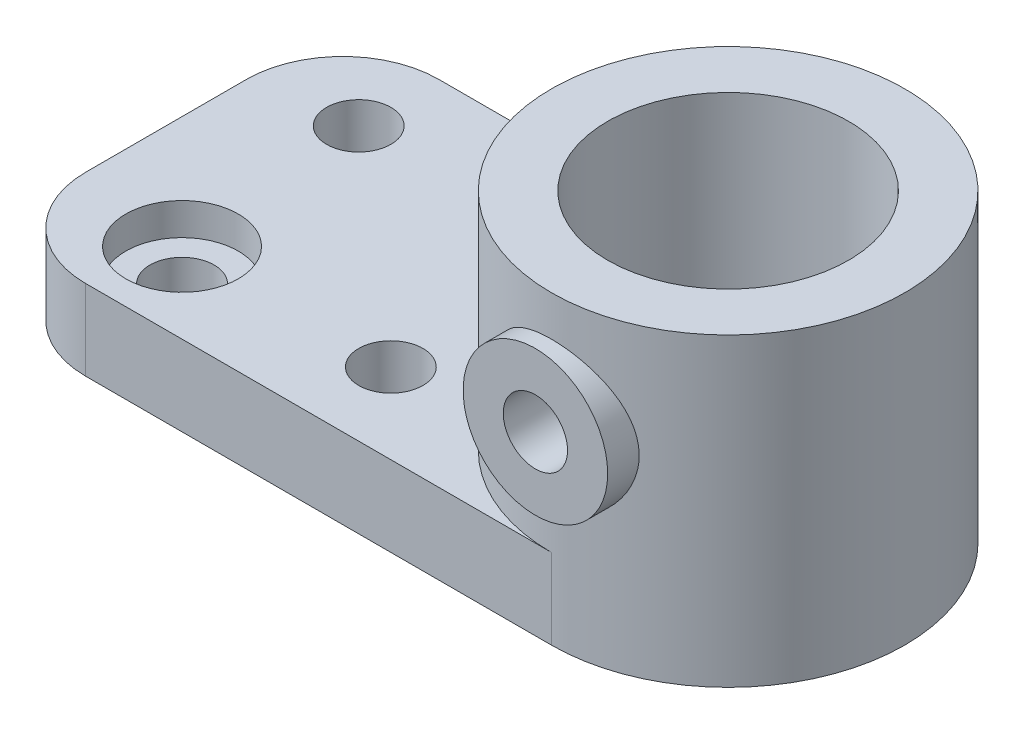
ISO-10303-21;
HEADER;
FILE_DESCRIPTION(('STEP AP214'),'2;1');
FILE_NAME('part.step','',(''),(''),'','','');
FILE_SCHEMA(('AUTOMOTIVE_DESIGN { 1 0 10303 214 1 1 1 1 }'));
ENDSEC;
DATA;
#1=APPLICATION_CONTEXT('core data for automotive mechanical design processes');
#2=APPLICATION_PROTOCOL_DEFINITION('international standard','automotive_design',2000,#1);
#3=PRODUCT_CONTEXT('',#1,'mechanical');
#4=PRODUCT('Part','Part','',(#3));
#5=PRODUCT_RELATED_PRODUCT_CATEGORY('part','',(#4));
#6=PRODUCT_DEFINITION_FORMATION('','',#4);
#7=PRODUCT_DEFINITION_CONTEXT('part definition',#1,'design');
#8=PRODUCT_DEFINITION('design','',#6,#7);
#9=PRODUCT_DEFINITION_SHAPE('','',#8);
#10=(LENGTH_UNIT() NAMED_UNIT(*) SI_UNIT(.MILLI.,.METRE.));
#11=(NAMED_UNIT(*) PLANE_ANGLE_UNIT() SI_UNIT($,.RADIAN.));
#12=(NAMED_UNIT(*) SI_UNIT($,.STERADIAN.) SOLID_ANGLE_UNIT());
#13=UNCERTAINTY_MEASURE_WITH_UNIT(LENGTH_MEASURE(1.E-05),#10,'distance_accuracy_value','');
#14=(GEOMETRIC_REPRESENTATION_CONTEXT(3) GLOBAL_UNCERTAINTY_ASSIGNED_CONTEXT((#13)) GLOBAL_UNIT_ASSIGNED_CONTEXT((#10,
#11,#12)) REPRESENTATION_CONTEXT('',''));
#15=CARTESIAN_POINT('',(0.,0.,0.));
#16=DIRECTION('',(0.,0.,1.));
#17=DIRECTION('',(1.,0.,0.));
#18=AXIS2_PLACEMENT_3D('',#15,#16,#17);
#19=CARTESIAN_POINT('',(-32.,10.,-12.));
#20=DIRECTION('',(0.,-1.,0.));
#21=DIRECTION('',(0.,0.,-1.));
#22=AXIS2_PLACEMENT_3D('',#19,#20,#21);
#23=CYLINDRICAL_SURFACE('',#22,4.);
#24=CARTESIAN_POINT('',(-32.,0.,-12.));
#25=DIRECTION('',(0.,1.,0.));
#26=DIRECTION('',(0.,0.,1.));
#27=AXIS2_PLACEMENT_3D('',#24,#25,#26);
#28=CIRCLE('',#27,4.);
#29=CARTESIAN_POINT('',(-32.,0.,-8.));
#30=VERTEX_POINT('',#29);
#31=EDGE_CURVE('E143',#30,#30,#28,.T.);
#32=ORIENTED_EDGE('',*,*,#31,.F.);
#33=EDGE_LOOP('',(#32));
#34=FACE_BOUND('',#33,.T.);
#35=CARTESIAN_POINT('',(-32.,6.,-12.));
#36=DIRECTION('',(0.,1.,0.));
#37=DIRECTION('',(0.,0.,1.));
#38=AXIS2_PLACEMENT_3D('',#35,#36,#37);
#39=CIRCLE('',#38,4.);
#40=CARTESIAN_POINT('',(-32.,6.,-8.));
#41=VERTEX_POINT('',#40);
#42=EDGE_CURVE('E34',#41,#41,#39,.T.);
#43=ORIENTED_EDGE('',*,*,#42,.T.);
#44=EDGE_LOOP('',(#43));
#45=FACE_BOUND('',#44,.T.);
#46=ADVANCED_FACE('F30',(#34,#45),#23,.F.);
#47=CARTESIAN_POINT('',(-56.,10.,12.));
#48=DIRECTION('',(0.,-1.,0.));
#49=DIRECTION('',(0.,0.,-1.));
#50=AXIS2_PLACEMENT_3D('',#47,#48,#49);
#51=CYLINDRICAL_SURFACE('',#50,4.);
#52=CARTESIAN_POINT('',(-56.,0.,12.));
#53=DIRECTION('',(0.,1.,0.));
#54=DIRECTION('',(0.,0.,1.));
#55=AXIS2_PLACEMENT_3D('',#52,#53,#54);
#56=CIRCLE('',#55,4.);
#57=CARTESIAN_POINT('',(-56.,0.,16.));
#58=VERTEX_POINT('',#57);
#59=EDGE_CURVE('E148',#58,#58,#56,.T.);
#60=ORIENTED_EDGE('',*,*,#59,.F.);
#61=EDGE_LOOP('',(#60));
#62=FACE_BOUND('',#61,.T.);
#63=CARTESIAN_POINT('',(-56.,6.,12.));
#64=DIRECTION('',(0.,1.,0.));
#65=DIRECTION('',(0.,0.,1.));
#66=AXIS2_PLACEMENT_3D('',#63,#64,#65);
#67=CIRCLE('',#66,4.);
#68=CARTESIAN_POINT('',(-56.,6.,16.));
#69=VERTEX_POINT('',#68);
#70=EDGE_CURVE('E164',#69,#69,#67,.T.);
#71=ORIENTED_EDGE('',*,*,#70,.T.);
#72=EDGE_LOOP('',(#71));
#73=FACE_BOUND('',#72,.T.);
#74=ADVANCED_FACE('F227',(#62,#73),#51,.F.);
#75=CARTESIAN_POINT('',(0.,10.,0.));
#76=DIRECTION('',(0.,1.,0.));
#77=DIRECTION('',(0.,0.,1.));
#78=AXIS2_PLACEMENT_3D('',#75,#76,#77);
#79=PLANE('',#78);
#80=CARTESIAN_POINT('',(0.,10.,0.));
#81=DIRECTION('',(0.,1.,0.));
#82=DIRECTION('',(0.,0.,1.));
#83=AXIS2_PLACEMENT_3D('',#80,#81,#82);
#84=CIRCLE('',#83,7.);
#85=CARTESIAN_POINT('',(0.,10.,7.));
#86=VERTEX_POINT('',#85);
#87=EDGE_CURVE('E132',#86,#86,#84,.T.);
#88=ORIENTED_EDGE('',*,*,#87,.F.);
#89=EDGE_LOOP('',(#88));
#90=FACE_BOUND('',#89,.T.);
#91=CARTESIAN_POINT('',(0.,10.,0.));
#92=DIRECTION('',(0.,1.,0.));
#93=DIRECTION('',(0.,0.,1.));
#94=AXIS2_PLACEMENT_3D('',#91,#92,#93);
#95=CIRCLE('',#94,15.);
#96=CARTESIAN_POINT('',(0.,10.,15.));
#97=VERTEX_POINT('',#96);
#98=EDGE_CURVE('E161',#97,#97,#95,.T.);
#99=ORIENTED_EDGE('',*,*,#98,.T.);
#100=EDGE_LOOP('',(#99));
#101=FACE_BOUND('',#100,.T.);
#102=ADVANCED_FACE('F230',(#90,#101),#79,.T.);
#103=CARTESIAN_POINT('',(-32.,10.,-12.));
#104=DIRECTION('',(0.,1.,0.));
#105=DIRECTION('',(0.,0.,1.));
#106=AXIS2_PLACEMENT_3D('',#103,#104,#105);
#107=CIRCLE('',#106,7.);
#108=CARTESIAN_POINT('',(-32.,10.,-5.));
#109=VERTEX_POINT('',#108);
#110=EDGE_CURVE('E173',#109,#109,#107,.T.);
#111=ORIENTED_EDGE('',*,*,#110,.F.);
#112=EDGE_LOOP('',(#111));
#113=FACE_BOUND('',#112,.T.);
#114=CARTESIAN_POINT('',(-56.,10.,12.));
#115=DIRECTION('',(0.,1.,0.));
#116=DIRECTION('',(0.,0.,1.));
#117=AXIS2_PLACEMENT_3D('',#114,#115,#116);
#118=CIRCLE('',#117,7.);
#119=CARTESIAN_POINT('',(-56.,10.,19.));
#120=VERTEX_POINT('',#119);
#121=EDGE_CURVE('E167',#120,#120,#118,.T.);
#122=ORIENTED_EDGE('',*,*,#121,.F.);
#123=EDGE_LOOP('',(#122));
#124=FACE_BOUND('',#123,.T.);
#125=DIRECTION('',(-1.,0.,0.));
#126=VECTOR('',#125,1.);
#127=CARTESIAN_POINT('',(0.,10.,-22.));
#128=LINE('',#127,#126);
#129=CARTESIAN_POINT('',(0.,10.,-22.));
#130=VERTEX_POINT('',#129);
#131=CARTESIAN_POINT('',(-58.,10.,-22.));
#132=VERTEX_POINT('',#131);
#133=EDGE_CURVE('E119',#130,#132,#128,.T.);
#134=ORIENTED_EDGE('',*,*,#133,.T.);
#135=CARTESIAN_POINT('',(-58.,10.,-9.99999999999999));
#136=DIRECTION('',(0.,1.,0.));
#137=DIRECTION('',(0.,0.,1.));
#138=AXIS2_PLACEMENT_3D('',#135,#136,#137);
#139=CIRCLE('',#138,12.);
#140=CARTESIAN_POINT('',(-70.,10.,-9.99999999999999));
#141=VERTEX_POINT('',#140);
#142=EDGE_CURVE('E39',#132,#141,#139,.T.);
#143=ORIENTED_EDGE('',*,*,#142,.T.);
#144=DIRECTION('',(0.,0.,1.));
#145=VECTOR('',#144,1.);
#146=CARTESIAN_POINT('',(-70.,10.,-22.));
#147=LINE('',#146,#145);
#148=CARTESIAN_POINT('',(-70.,10.,9.99999999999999));
#149=VERTEX_POINT('',#148);
#150=EDGE_CURVE('E94',#141,#149,#147,.T.);
#151=ORIENTED_EDGE('',*,*,#150,.T.);
#152=CARTESIAN_POINT('',(-58.,10.,9.99999999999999));
#153=DIRECTION('',(0.,1.,0.));
#154=DIRECTION('',(0.,0.,1.));
#155=AXIS2_PLACEMENT_3D('',#152,#153,#154);
#156=CIRCLE('',#155,12.);
#157=CARTESIAN_POINT('',(-58.,10.,22.));
#158=VERTEX_POINT('',#157);
#159=EDGE_CURVE('E47',#149,#158,#156,.T.);
#160=ORIENTED_EDGE('',*,*,#159,.T.);
#161=DIRECTION('',(1.,0.,0.));
#162=VECTOR('',#161,1.);
#163=CARTESIAN_POINT('',(0.,10.,22.));
#164=LINE('',#163,#162);
#165=CARTESIAN_POINT('',(0.,10.,22.));
#166=VERTEX_POINT('',#165);
#167=EDGE_CURVE('E85',#158,#166,#164,.T.);
#168=ORIENTED_EDGE('',*,*,#167,.T.);
#169=CARTESIAN_POINT('',(0.,10.,0.));
#170=DIRECTION('',(0.,1.,0.));
#171=DIRECTION('',(0.,0.,1.));
#172=AXIS2_PLACEMENT_3D('',#169,#170,#171);
#173=CIRCLE('',#172,22.);
#174=EDGE_CURVE('E90',#130,#166,#173,.T.);
#175=ORIENTED_EDGE('',*,*,#174,.F.);
#176=EDGE_LOOP('',(#134,#143,#151,#160,#168,#175));
#177=FACE_BOUND('',#176,.T.);
#178=CARTESIAN_POINT('',(-58.,10.,-12.));
#179=DIRECTION('',(0.,1.,0.));
#180=DIRECTION('',(0.,0.,1.));
#181=AXIS2_PLACEMENT_3D('',#178,#179,#180);
#182=CIRCLE('',#181,4.);
#183=CARTESIAN_POINT('',(-58.,10.,-8.));
#184=VERTEX_POINT('',#183);
#185=EDGE_CURVE('E137',#184,#184,#182,.T.);
#186=ORIENTED_EDGE('',*,*,#185,.F.);
#187=EDGE_LOOP('',(#186));
#188=FACE_BOUND('',#187,.T.);
#189=CARTESIAN_POINT('',(-30.,10.,12.));
#190=DIRECTION('',(0.,1.,0.));
#191=DIRECTION('',(0.,0.,1.));
#192=AXIS2_PLACEMENT_3D('',#189,#190,#191);
#193=CIRCLE('',#192,4.);
#194=CARTESIAN_POINT('',(-30.,10.,16.));
#195=VERTEX_POINT('',#194);
#196=EDGE_CURVE('E151',#195,#195,#193,.T.);
#197=ORIENTED_EDGE('',*,*,#196,.F.);
#198=EDGE_LOOP('',(#197));
#199=FACE_BOUND('',#198,.T.);
#200=ADVANCED_FACE('F87',(#113,#124,#177,#188,#199),#79,.T.);
#201=CARTESIAN_POINT('',(0.,0.,0.));
#202=DIRECTION('',(0.,1.,0.));
#203=DIRECTION('',(0.,0.,1.));
#204=AXIS2_PLACEMENT_3D('',#201,#202,#203);
#205=PLANE('',#204);
#206=ORIENTED_EDGE('',*,*,#59,.T.);
#207=EDGE_LOOP('',(#206));
#208=FACE_BOUND('',#207,.T.);
#209=CARTESIAN_POINT('',(-58.,0.,-12.));
#210=DIRECTION('',(0.,1.,0.));
#211=DIRECTION('',(0.,0.,1.));
#212=AXIS2_PLACEMENT_3D('',#209,#210,#211);
#213=CIRCLE('',#212,4.);
#214=CARTESIAN_POINT('',(-58.,0.,-8.));
#215=VERTEX_POINT('',#214);
#216=EDGE_CURVE('E140',#215,#215,#213,.T.);
#217=ORIENTED_EDGE('',*,*,#216,.T.);
#218=EDGE_LOOP('',(#217));
#219=FACE_BOUND('',#218,.T.);
#220=DIRECTION('',(0.,0.,1.));
#221=VECTOR('',#220,1.);
#222=CARTESIAN_POINT('',(-70.,0.,-22.));
#223=LINE('',#222,#221);
#224=CARTESIAN_POINT('',(-70.,0.,-9.99999999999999));
#225=VERTEX_POINT('',#224);
#226=CARTESIAN_POINT('',(-70.,0.,9.99999999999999));
#227=VERTEX_POINT('',#226);
#228=EDGE_CURVE('E125',#225,#227,#223,.T.);
#229=ORIENTED_EDGE('',*,*,#228,.F.);
#230=CARTESIAN_POINT('',(-58.,0.,-9.99999999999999));
#231=DIRECTION('',(0.,1.,0.));
#232=DIRECTION('',(0.,0.,1.));
#233=AXIS2_PLACEMENT_3D('',#230,#231,#232);
#234=CIRCLE('',#233,12.);
#235=CARTESIAN_POINT('',(-58.,0.,-22.));
#236=VERTEX_POINT('',#235);
#237=EDGE_CURVE('E460',#225,#236,#234,.F.);
#238=ORIENTED_EDGE('',*,*,#237,.T.);
#239=DIRECTION('',(-1.,0.,0.));
#240=VECTOR('',#239,1.);
#241=CARTESIAN_POINT('',(0.,0.,-22.));
#242=LINE('',#241,#240);
#243=CARTESIAN_POINT('',(0.,0.,-22.));
#244=VERTEX_POINT('',#243);
#245=EDGE_CURVE('E128',#244,#236,#242,.T.);
#246=ORIENTED_EDGE('',*,*,#245,.F.);
#247=CARTESIAN_POINT('',(0.,0.,0.));
#248=DIRECTION('',(0.,1.,0.));
#249=DIRECTION('',(0.,0.,1.));
#250=AXIS2_PLACEMENT_3D('',#247,#248,#249);
#251=CIRCLE('',#250,22.);
#252=CARTESIAN_POINT('',(0.,0.,22.));
#253=VERTEX_POINT('',#252);
#254=EDGE_CURVE('E130',#253,#244,#251,.T.);
#255=ORIENTED_EDGE('',*,*,#254,.F.);
#256=DIRECTION('',(1.,0.,0.));
#257=VECTOR('',#256,1.);
#258=CARTESIAN_POINT('',(0.,0.,22.));
#259=LINE('',#258,#257);
#260=CARTESIAN_POINT('',(-58.,0.,22.));
#261=VERTEX_POINT('',#260);
#262=EDGE_CURVE('E99',#261,#253,#259,.T.);
#263=ORIENTED_EDGE('',*,*,#262,.F.);
#264=CARTESIAN_POINT('',(-58.,0.,9.99999999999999));
#265=DIRECTION('',(0.,1.,0.));
#266=DIRECTION('',(0.,0.,1.));
#267=AXIS2_PLACEMENT_3D('',#264,#265,#266);
#268=CIRCLE('',#267,12.);
#269=EDGE_CURVE('E462',#261,#227,#268,.F.);
#270=ORIENTED_EDGE('',*,*,#269,.T.);
#271=EDGE_LOOP('',(#229,#238,#246,#255,#263,#270));
#272=FACE_BOUND('',#271,.T.);
#273=CARTESIAN_POINT('',(0.,0.,0.));
#274=DIRECTION('',(0.,1.,0.));
#275=DIRECTION('',(0.,0.,1.));
#276=AXIS2_PLACEMENT_3D('',#273,#274,#275);
#277=CIRCLE('',#276,7.);
#278=CARTESIAN_POINT('',(0.,0.,7.));
#279=VERTEX_POINT('',#278);
#280=EDGE_CURVE('E134',#279,#279,#277,.T.);
#281=ORIENTED_EDGE('',*,*,#280,.T.);
#282=EDGE_LOOP('',(#281));
#283=FACE_BOUND('',#282,.T.);
#284=ORIENTED_EDGE('',*,*,#31,.T.);
#285=EDGE_LOOP('',(#284));
#286=FACE_BOUND('',#285,.T.);
#287=CARTESIAN_POINT('',(-30.,0.,12.));
#288=DIRECTION('',(0.,1.,0.));
#289=DIRECTION('',(0.,0.,1.));
#290=AXIS2_PLACEMENT_3D('',#287,#288,#289);
#291=CIRCLE('',#290,4.);
#292=CARTESIAN_POINT('',(-30.,0.,16.));
#293=VERTEX_POINT('',#292);
#294=EDGE_CURVE('E152',#293,#293,#291,.T.);
#295=ORIENTED_EDGE('',*,*,#294,.T.);
#296=EDGE_LOOP('',(#295));
#297=FACE_BOUND('',#296,.T.);
#298=ADVANCED_FACE('F244',(#208,#219,#272,#283,#286,#297),#205,.F.);
#299=CARTESIAN_POINT('',(0.,10.,0.));
#300=DIRECTION('',(0.,-1.,0.));
#301=DIRECTION('',(0.,0.,-1.));
#302=AXIS2_PLACEMENT_3D('',#299,#300,#301);
#303=CYLINDRICAL_SURFACE('',#302,22.);
#304=CARTESIAN_POINT('',(9.,24.,20.0748598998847));
#305=CARTESIAN_POINT('',(8.99999844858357,24.2405702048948,20.0748614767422));
#306=CARTESIAN_POINT('',(8.9903402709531,24.4812310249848,20.0791991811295));
#307=CARTESIAN_POINT('',(8.95180335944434,24.9608098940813,20.0964088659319));
#308=CARTESIAN_POINT('',(8.92291178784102,25.1997266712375,20.109286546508));
#309=CARTESIAN_POINT('',(8.84613828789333,25.6744444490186,20.1431774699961));
#310=CARTESIAN_POINT('',(8.79821526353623,25.9102375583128,20.1642083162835));
#311=CARTESIAN_POINT('',(8.68386615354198,26.3765828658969,20.2137167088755));
#312=CARTESIAN_POINT('',(8.617432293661,26.6071328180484,20.2421973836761));
#313=CARTESIAN_POINT('',(8.46704126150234,27.0603855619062,20.3055616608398));
#314=CARTESIAN_POINT('',(8.38316305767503,27.2831186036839,20.3404163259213));
#315=CARTESIAN_POINT('',(8.19842695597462,27.7205142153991,20.4155755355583));
#316=CARTESIAN_POINT('',(8.09756258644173,27.9351736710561,20.4558821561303));
#317=CARTESIAN_POINT('',(7.77079118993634,28.5648789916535,20.5832342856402));
#318=CARTESIAN_POINT('',(7.5205100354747,28.9662370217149,20.6767985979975));
#319=CARTESIAN_POINT('',(6.94617089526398,29.7443091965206,20.8769660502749));
#320=CARTESIAN_POINT('',(6.61884295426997,30.1184991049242,20.9840014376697));
#321=CARTESIAN_POINT('',(6.08506424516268,30.6357820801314,21.1425316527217));
#322=CARTESIAN_POINT('',(5.89986332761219,30.800975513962,21.1950737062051));
#323=CARTESIAN_POINT('',(5.51614475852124,31.1157324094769,21.2981582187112));
#324=CARTESIAN_POINT('',(5.31763208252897,31.2653016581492,21.3487014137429));
#325=CARTESIAN_POINT('',(4.89974411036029,31.5537851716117,21.4485567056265));
#326=CARTESIAN_POINT('',(4.67984240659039,31.6919861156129,21.4977274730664));
#327=CARTESIAN_POINT('',(4.22819576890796,31.9492048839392,21.5910977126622));
#328=CARTESIAN_POINT('',(3.99645573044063,32.0682305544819,21.6352992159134));
#329=CARTESIAN_POINT('',(3.52262602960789,32.2860780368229,21.7174793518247));
#330=CARTESIAN_POINT('',(3.28053752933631,32.3849021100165,21.7554586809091));
#331=CARTESIAN_POINT('',(2.7877499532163,32.5613625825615,21.8240765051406));
#332=CARTESIAN_POINT('',(2.53705145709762,32.6390004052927,21.8547154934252));
#333=CARTESIAN_POINT('',(2.04181073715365,32.7688769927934,21.9063880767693));
#334=CARTESIAN_POINT('',(1.79759452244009,32.8221981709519,21.9278277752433));
#335=CARTESIAN_POINT('',(1.30501003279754,32.9083924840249,21.9626477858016));
#336=CARTESIAN_POINT('',(1.05664188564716,32.9412662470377,21.9760283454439));
#337=CARTESIAN_POINT('',(0.557801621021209,32.9861867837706,21.9943431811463));
#338=CARTESIAN_POINT('',(0.307330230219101,32.9982404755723,21.9992802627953));
#339=CARTESIAN_POINT('',(-0.193762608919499,33.0014012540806,22.0005731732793));
#340=CARTESIAN_POINT('',(-0.444384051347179,32.9925091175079,21.9969293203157));
#341=CARTESIAN_POINT('',(-0.929001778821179,32.9550263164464,21.9816339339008));
#342=CARTESIAN_POINT('',(-1.16310681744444,32.9276283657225,21.9704673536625));
#343=CARTESIAN_POINT('',(-1.62808495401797,32.8546450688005,21.9409121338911));
#344=CARTESIAN_POINT('',(-1.85895689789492,32.8090533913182,21.922520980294));
#345=CARTESIAN_POINT('',(-2.31573892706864,32.7001417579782,21.8789848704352));
#346=CARTESIAN_POINT('',(-2.54165066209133,32.6368277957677,21.8538421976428));
#347=CARTESIAN_POINT('',(-2.98723296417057,32.4930130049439,21.7974057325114));
#348=CARTESIAN_POINT('',(-3.20690112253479,32.4125056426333,21.7661096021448));
#349=CARTESIAN_POINT('',(-3.64178804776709,32.2336791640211,21.6976162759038));
#350=CARTESIAN_POINT('',(-3.85689296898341,32.1351142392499,21.6603386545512));
#351=CARTESIAN_POINT('',(-4.27807025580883,31.9217339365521,21.5811041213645));
#352=CARTESIAN_POINT('',(-4.48413952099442,31.8069130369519,21.5391456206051));
#353=CARTESIAN_POINT('',(-4.88609037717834,31.5618472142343,21.4515369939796));
#354=CARTESIAN_POINT('',(-5.08197092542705,31.4316007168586,21.4058864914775));
#355=CARTESIAN_POINT('',(-5.46254072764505,31.1565202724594,21.311946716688));
#356=CARTESIAN_POINT('',(-5.64722936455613,31.0116855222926,21.2636572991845));
#357=CARTESIAN_POINT('',(-6.0167506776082,30.6978668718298,21.1621807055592));
#358=CARTESIAN_POINT('',(-6.20072670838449,30.5279083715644,21.1088846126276));
#359=CARTESIAN_POINT('',(-6.55378061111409,30.1733727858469,21.0019517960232));
#360=CARTESIAN_POINT('',(-6.72286276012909,29.9887999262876,20.9483151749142));
#361=CARTESIAN_POINT('',(-7.04532756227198,29.6058943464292,20.842077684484));
#362=CARTESIAN_POINT('',(-7.19869891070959,29.4075518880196,20.7894775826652));
#363=CARTESIAN_POINT('',(-7.48858052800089,28.9983994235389,20.6868267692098));
#364=CARTESIAN_POINT('',(-7.62509729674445,28.7875942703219,20.6367750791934));
#365=CARTESIAN_POINT('',(-7.88437541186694,28.347848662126,20.5391435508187));
#366=CARTESIAN_POINT('',(-8.00657342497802,28.1185473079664,20.4916898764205));
#367=CARTESIAN_POINT('',(-8.23100350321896,27.6494058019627,20.4025773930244));
#368=CARTESIAN_POINT('',(-8.3332442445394,27.4095702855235,20.360916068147));
#369=CARTESIAN_POINT('',(-8.51680121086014,26.9209879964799,20.284821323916));
#370=CARTESIAN_POINT('',(-8.59812432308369,26.6722441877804,20.250385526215));
#371=CARTESIAN_POINT('',(-8.73898441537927,26.1676587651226,20.1899985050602));
#372=CARTESIAN_POINT('',(-8.79852324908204,25.911817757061,20.1640465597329));
#373=CARTESIAN_POINT('',(-8.89203839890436,25.4114793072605,20.1229741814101));
#374=CARTESIAN_POINT('',(-8.92739213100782,25.167286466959,20.1072729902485));
#375=CARTESIAN_POINT('',(-8.97793562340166,24.6764157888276,20.0847565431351));
#376=CARTESIAN_POINT('',(-8.99312624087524,24.4297380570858,20.0779409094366));
#377=CARTESIAN_POINT('',(-9.00315857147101,23.9359571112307,20.0734442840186));
#378=CARTESIAN_POINT('',(-8.99800605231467,23.6888540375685,20.0757607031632));
#379=CARTESIAN_POINT('',(-8.96742781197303,23.1961634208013,20.0894379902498));
#380=CARTESIAN_POINT('',(-8.94200265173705,22.9505758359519,20.1007986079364));
#381=CARTESIAN_POINT('',(-8.87334991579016,22.477763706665,20.1311938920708));
#382=CARTESIAN_POINT('',(-8.83130364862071,22.250333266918,20.1497178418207));
#383=CARTESIAN_POINT('',(-8.73001076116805,21.7999532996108,20.1938099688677));
#384=CARTESIAN_POINT('',(-8.67075819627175,21.5770053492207,20.2193805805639));
#385=CARTESIAN_POINT('',(-8.53561672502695,21.1371019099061,20.2768002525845));
#386=CARTESIAN_POINT('',(-8.45973124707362,20.9201451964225,20.3086480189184));
#387=CARTESIAN_POINT('',(-8.29191569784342,20.4933288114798,20.3777418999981));
#388=CARTESIAN_POINT('',(-8.19997935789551,20.2834719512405,20.4149901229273));
#389=CARTESIAN_POINT('',(-7.9966623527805,19.8635741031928,20.4955075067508));
#390=CARTESIAN_POINT('',(-7.88463748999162,19.6538805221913,20.538961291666));
#391=CARTESIAN_POINT('',(-7.64469982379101,19.2444887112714,20.6294693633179));
#392=CARTESIAN_POINT('',(-7.5167800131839,19.0447949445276,20.6765252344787));
#393=CARTESIAN_POINT('',(-7.24587633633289,18.6564683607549,20.7730100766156));
#394=CARTESIAN_POINT('',(-7.10289031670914,18.4678371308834,20.8224393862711));
#395=CARTESIAN_POINT('',(-6.80267836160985,18.1025889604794,20.9224424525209));
#396=CARTESIAN_POINT('',(-6.64545183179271,17.9259725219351,20.9730162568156));
#397=CARTESIAN_POINT('',(-6.30474917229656,17.5723222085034,21.0780535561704));
#398=CARTESIAN_POINT('',(-6.12018177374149,17.3963362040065,21.1325118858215));
#399=CARTESIAN_POINT('',(-5.73658962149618,17.0605115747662,21.2398490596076));
#400=CARTESIAN_POINT('',(-5.53756980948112,16.9006674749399,21.2927284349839));
#401=CARTESIAN_POINT('',(-5.12605817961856,16.5980554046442,21.3955256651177));
#402=CARTESIAN_POINT('',(-4.91355977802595,16.4552958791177,21.4454420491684));
#403=CARTESIAN_POINT('',(-4.4765406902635,16.1880764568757,21.5409047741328));
#404=CARTESIAN_POINT('',(-4.25202525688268,16.0636086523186,21.5864530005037));
#405=CARTESIAN_POINT('',(-3.79196072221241,15.8337738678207,21.6720061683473));
#406=CARTESIAN_POINT('',(-3.55639549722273,15.7284359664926,21.7120026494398));
#407=CARTESIAN_POINT('',(-3.07615798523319,15.538087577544,21.785229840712));
#408=CARTESIAN_POINT('',(-2.83148560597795,15.4530772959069,21.8184604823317));
#409=CARTESIAN_POINT('',(-2.33497297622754,15.3043096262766,21.8771652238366));
#410=CARTESIAN_POINT('',(-2.08313615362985,15.2405422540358,21.9026429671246));
#411=CARTESIAN_POINT('',(-1.57420540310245,15.1349335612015,21.9450918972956));
#412=CARTESIAN_POINT('',(-1.31711185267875,15.0930906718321,21.9620636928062));
#413=CARTESIAN_POINT('',(-0.81739315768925,15.0339073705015,21.9861352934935));
#414=CARTESIAN_POINT('',(-0.574969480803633,15.0150974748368,21.9938266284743));
#415=CARTESIAN_POINT('',(-0.089278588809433,14.9971629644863,22.0011591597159));
#416=CARTESIAN_POINT('',(0.153988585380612,14.9980374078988,22.0008007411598));
#417=CARTESIAN_POINT('',(0.639469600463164,15.0194593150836,21.9920444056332));
#418=CARTESIAN_POINT('',(0.881683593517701,15.0400038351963,21.983647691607));
#419=CARTESIAN_POINT('',(1.36326429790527,15.1005390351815,21.9590446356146));
#420=CARTESIAN_POINT('',(1.60263102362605,15.1405296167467,21.9428383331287));
#421=CARTESIAN_POINT('',(2.06880772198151,15.2378755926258,21.9037191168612));
#422=CARTESIAN_POINT('',(2.29576961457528,15.2946038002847,21.8810492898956));
#423=CARTESIAN_POINT('',(2.74400546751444,15.4253306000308,21.8293690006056));
#424=CARTESIAN_POINT('',(2.96527740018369,15.4993352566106,21.8003563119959));
#425=CARTESIAN_POINT('',(3.40065077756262,15.6639501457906,21.7366963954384));
#426=CARTESIAN_POINT('',(3.61475385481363,15.7545565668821,21.702050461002));
#427=CARTESIAN_POINT('',(4.0347085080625,15.9517107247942,21.6279129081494));
#428=CARTESIAN_POINT('',(4.24055690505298,16.0582645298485,21.5884194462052));
#429=CARTESIAN_POINT('',(4.65177695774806,16.2916075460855,21.5036503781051));
#430=CARTESIAN_POINT('',(4.85672088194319,16.419085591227,21.4581958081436));
#431=CARTESIAN_POINT('',(5.25528763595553,16.6897330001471,21.3640797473));
#432=CARTESIAN_POINT('',(5.44890652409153,16.8329077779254,21.3154171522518));
#433=CARTESIAN_POINT('',(5.82377239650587,17.134034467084,21.2160618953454));
#434=CARTESIAN_POINT('',(6.00501779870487,17.2919882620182,21.165368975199));
#435=CARTESIAN_POINT('',(6.3541880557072,17.6217582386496,21.0631762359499));
#436=CARTESIAN_POINT('',(6.52211227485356,17.7935750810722,21.0116763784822));
#437=CARTESIAN_POINT('',(6.85428506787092,18.1618310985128,20.9057676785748));
#438=CARTESIAN_POINT('',(7.0175742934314,18.3591457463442,20.8513889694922));
#439=CARTESIAN_POINT('',(7.32693481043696,18.7672596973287,20.7447053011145));
#440=CARTESIAN_POINT('',(7.4730118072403,18.9780544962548,20.6923996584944));
#441=CARTESIAN_POINT('',(7.74712722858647,19.4121917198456,20.5913425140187));
#442=CARTESIAN_POINT('',(7.87514741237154,19.635546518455,20.5425946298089));
#443=CARTESIAN_POINT('',(8.11189940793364,20.0931576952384,20.4502624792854));
#444=CARTESIAN_POINT('',(8.22063998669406,20.3274090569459,20.4066758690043));
#445=CARTESIAN_POINT('',(8.41723405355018,20.8037372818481,20.3263714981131));
#446=CARTESIAN_POINT('',(8.50522590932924,21.0457493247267,20.2896086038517));
#447=CARTESIAN_POINT('',(8.66033735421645,21.5372923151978,20.2238883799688));
#448=CARTESIAN_POINT('',(8.7274671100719,21.7868195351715,20.1949272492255));
#449=CARTESIAN_POINT('',(8.8399898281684,22.2908779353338,20.1459261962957));
#450=CARTESIAN_POINT('',(8.8854402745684,22.5453939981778,20.1258626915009));
#451=CARTESIAN_POINT('',(8.95427558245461,23.0578293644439,20.0953324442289));
#452=CARTESIAN_POINT('',(8.97767776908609,23.3157458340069,20.0848581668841));
#453=CARTESIAN_POINT('',(8.99328032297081,23.6450930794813,20.0778711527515));
#454=CARTESIAN_POINT('',(8.99579955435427,23.7160437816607,20.0767425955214));
#455=CARTESIAN_POINT('',(8.99915962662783,23.8579936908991,20.0752367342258));
#456=CARTESIAN_POINT('',(9.00000045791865,23.9289928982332,20.0748594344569));
#457=CARTESIAN_POINT('',(9.,24.,20.0748598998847));
#458=B_SPLINE_CURVE_WITH_KNOTS('',3,(#304,#305,#306,#307,#308,#309,#310,#311,#312,#313,#314,
#315,#316,#317,#318,#319,#320,#321,#322,#323,#324,#325,#326,#327,#328,#329,#330,#331,#332,#333,
#334,#335,#336,#337,#338,#339,#340,#341,#342,#343,#344,#345,#346,#347,#348,#349,#350,#351,#352,
#353,#354,#355,#356,#357,#358,#359,#360,#361,#362,#363,#364,#365,#366,#367,#368,#369,#370,#371,
#372,#373,#374,#375,#376,#377,#378,#379,#380,#381,#382,#383,#384,#385,#386,#387,#388,#389,#390,
#391,#392,#393,#394,#395,#396,#397,#398,#399,#400,#401,#402,#403,#404,#405,#406,#407,#408,#409,
#410,#411,#412,#413,#414,#415,#416,#417,#418,#419,#420,#421,#422,#423,#424,#425,#426,#427,#428,
#429,#430,#431,#432,#433,#434,#435,#436,#437,#438,#439,#440,#441,#442,#443,#444,#445,#446,#447,
#448,#449,#450,#451,#452,#453,#454,#455,#456,#457),.UNSPECIFIED.,.T.,.F.,(4,2,2,2,2,2,2,2,2,2,2,
2,2,2,2,2,2,2,2,2,2,2,2,2,2,2,2,2,2,2,2,2,2,2,2,2,2,2,2,2,2,2,2,2,2,2,2,2,2,2,2,2,2,2,2,2,2,2,2,
2,2,2,2,2,2,2,2,2,2,2,2,2,2,2,2,2,4),(0.,0.721636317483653,1.44375478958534,2.16744113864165,
2.8914318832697,3.61221389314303,4.3332711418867,5.77353798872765,7.29206774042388,
8.05238963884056,8.81242891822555,9.6044543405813,10.3961548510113,11.1877666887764,
11.9793253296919,12.7310113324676,13.4826742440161,14.2340873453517,14.985472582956,
15.6925424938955,16.3998586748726,17.1069359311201,17.814282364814,18.5320896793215,
19.2501413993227,19.968266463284,20.6864310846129,21.4537873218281,22.2209224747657,
22.9886057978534,23.755992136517,24.5473647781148,25.3383926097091,26.1291596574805,
26.9198594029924,27.660601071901,28.4013112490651,29.1418114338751,29.8822911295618,
30.5775748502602,31.273099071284,31.9684800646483,32.6641332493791,33.3883974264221,
34.112982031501,34.8376703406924,35.5623889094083,36.3437927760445,37.1249307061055,
37.9064531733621,38.6876367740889,39.4699980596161,40.2523672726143,41.0343682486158,
41.8163132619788,42.5452191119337,43.2740900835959,44.0028519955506,44.7316102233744,
45.4359337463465,46.1405048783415,46.8449144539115,47.5495927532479,48.285587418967,
49.0218367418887,49.7581800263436,50.4945584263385,51.2791167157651,52.0634142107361,
52.8484984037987,53.6332246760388,54.4125596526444,55.1915142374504,55.9683917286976,
56.7446582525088,56.9576564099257,57.1706557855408),.UNSPECIFIED.);
#459=CARTESIAN_POINT('',(9.,24.,20.0748598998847));
#460=VERTEX_POINT('',#459);
#461=EDGE_CURVE('E180',#460,#460,#458,.T.);
#462=ORIENTED_EDGE('',*,*,#461,.F.);
#463=EDGE_LOOP('',(#462));
#464=FACE_BOUND('',#463,.T.);
#465=ORIENTED_EDGE('',*,*,#254,.T.);
#466=DIRECTION('',(0.,-1.,0.));
#467=VECTOR('',#466,1.);
#468=CARTESIAN_POINT('',(0.,10.,-22.));
#469=LINE('',#468,#467);
#470=EDGE_CURVE('E103',#130,#244,#469,.T.);
#471=ORIENTED_EDGE('',*,*,#470,.F.);
#472=ORIENTED_EDGE('',*,*,#174,.T.);
#473=DIRECTION('',(0.,-1.,0.));
#474=VECTOR('',#473,1.);
#475=CARTESIAN_POINT('',(0.,10.,22.));
#476=LINE('',#475,#474);
#477=EDGE_CURVE('E93',#166,#253,#476,.T.);
#478=ORIENTED_EDGE('',*,*,#477,.T.);
#479=EDGE_LOOP('',(#465,#471,#472,#478));
#480=FACE_BOUND('',#479,.T.);
#481=CARTESIAN_POINT('',(0.,38.,0.));
#482=DIRECTION('',(0.,1.,0.));
#483=DIRECTION('',(0.,0.,1.));
#484=AXIS2_PLACEMENT_3D('',#481,#482,#483);
#485=CIRCLE('',#484,22.);
#486=CARTESIAN_POINT('',(0.,38.,22.));
#487=VERTEX_POINT('',#486);
#488=EDGE_CURVE('E155',#487,#487,#485,.T.);
#489=ORIENTED_EDGE('',*,*,#488,.F.);
#490=EDGE_LOOP('',(#489));
#491=FACE_BOUND('',#490,.T.);
#492=ADVANCED_FACE('F106',(#464,#480,#491),#303,.T.);
#493=CARTESIAN_POINT('',(0.,10.,-22.));
#494=DIRECTION('',(0.,0.,1.));
#495=DIRECTION('',(1.,0.,0.));
#496=AXIS2_PLACEMENT_3D('',#493,#494,#495);
#497=PLANE('',#496);
#498=ORIENTED_EDGE('',*,*,#245,.T.);
#499=DIRECTION('',(0.,-1.,0.));
#500=VECTOR('',#499,1.);
#501=CARTESIAN_POINT('',(-58.,10.,-22.));
#502=LINE('',#501,#500);
#503=EDGE_CURVE('E55',#236,#132,#502,.F.);
#504=ORIENTED_EDGE('',*,*,#503,.T.);
#505=ORIENTED_EDGE('',*,*,#133,.F.);
#506=ORIENTED_EDGE('',*,*,#470,.T.);
#507=EDGE_LOOP('',(#498,#504,#505,#506));
#508=FACE_BOUND('',#507,.T.);
#509=ADVANCED_FACE('F254',(#508),#497,.F.);
#510=CARTESIAN_POINT('',(-70.,10.,-22.));
#511=DIRECTION('',(1.,0.,0.));
#512=DIRECTION('',(0.,0.,-1.));
#513=AXIS2_PLACEMENT_3D('',#510,#511,#512);
#514=PLANE('',#513);
#515=ORIENTED_EDGE('',*,*,#150,.F.);
#516=DIRECTION('',(0.,-1.,0.));
#517=VECTOR('',#516,1.);
#518=CARTESIAN_POINT('',(-70.,10.,-9.99999999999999));
#519=LINE('',#518,#517);
#520=EDGE_CURVE('E111',#141,#225,#519,.T.);
#521=ORIENTED_EDGE('',*,*,#520,.T.);
#522=ORIENTED_EDGE('',*,*,#228,.T.);
#523=DIRECTION('',(0.,-1.,0.));
#524=VECTOR('',#523,1.);
#525=CARTESIAN_POINT('',(-70.,10.,9.99999999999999));
#526=LINE('',#525,#524);
#527=EDGE_CURVE('E109',#227,#149,#526,.F.);
#528=ORIENTED_EDGE('',*,*,#527,.T.);
#529=EDGE_LOOP('',(#515,#521,#522,#528));
#530=FACE_BOUND('',#529,.T.);
#531=ADVANCED_FACE('F251',(#530),#514,.F.);
#532=CARTESIAN_POINT('',(0.,10.,22.));
#533=DIRECTION('',(0.,0.,-1.));
#534=DIRECTION('',(-1.,0.,0.));
#535=AXIS2_PLACEMENT_3D('',#532,#533,#534);
#536=PLANE('',#535);
#537=ORIENTED_EDGE('',*,*,#167,.F.);
#538=DIRECTION('',(0.,-1.,0.));
#539=VECTOR('',#538,1.);
#540=CARTESIAN_POINT('',(-58.,10.,22.));
#541=LINE('',#540,#539);
#542=EDGE_CURVE('E11',#158,#261,#541,.T.);
#543=ORIENTED_EDGE('',*,*,#542,.T.);
#544=ORIENTED_EDGE('',*,*,#262,.T.);
#545=ORIENTED_EDGE('',*,*,#477,.F.);
#546=EDGE_LOOP('',(#537,#543,#544,#545));
#547=FACE_BOUND('',#546,.T.);
#548=ADVANCED_FACE('F97',(#547),#536,.F.);
#549=CARTESIAN_POINT('',(0.,10.,0.));
#550=DIRECTION('',(0.,-1.,0.));
#551=DIRECTION('',(0.,0.,-1.));
#552=AXIS2_PLACEMENT_3D('',#549,#550,#551);
#553=CYLINDRICAL_SURFACE('',#552,7.);
#554=ORIENTED_EDGE('',*,*,#87,.T.);
#555=EDGE_LOOP('',(#554));
#556=FACE_BOUND('',#555,.T.);
#557=ORIENTED_EDGE('',*,*,#280,.F.);
#558=EDGE_LOOP('',(#557));
#559=FACE_BOUND('',#558,.T.);
#560=ADVANCED_FACE('F237',(#556,#559),#553,.F.);
#561=CARTESIAN_POINT('',(-58.,10.,-12.));
#562=DIRECTION('',(0.,-1.,0.));
#563=DIRECTION('',(0.,0.,-1.));
#564=AXIS2_PLACEMENT_3D('',#561,#562,#563);
#565=CYLINDRICAL_SURFACE('',#564,4.);
#566=ORIENTED_EDGE('',*,*,#185,.T.);
#567=EDGE_LOOP('',(#566));
#568=FACE_BOUND('',#567,.T.);
#569=ORIENTED_EDGE('',*,*,#216,.F.);
#570=EDGE_LOOP('',(#569));
#571=FACE_BOUND('',#570,.T.);
#572=ADVANCED_FACE('F225',(#568,#571),#565,.F.);
#573=CARTESIAN_POINT('',(-30.,10.,12.));
#574=DIRECTION('',(0.,-1.,0.));
#575=DIRECTION('',(0.,0.,-1.));
#576=AXIS2_PLACEMENT_3D('',#573,#574,#575);
#577=CYLINDRICAL_SURFACE('',#576,4.);
#578=ORIENTED_EDGE('',*,*,#196,.T.);
#579=EDGE_LOOP('',(#578));
#580=FACE_BOUND('',#579,.T.);
#581=ORIENTED_EDGE('',*,*,#294,.F.);
#582=EDGE_LOOP('',(#581));
#583=FACE_BOUND('',#582,.T.);
#584=ADVANCED_FACE('F221',(#580,#583),#577,.F.);
#585=CARTESIAN_POINT('',(0.,38.,0.));
#586=DIRECTION('',(0.,1.,0.));
#587=DIRECTION('',(0.,0.,1.));
#588=AXIS2_PLACEMENT_3D('',#585,#586,#587);
#589=PLANE('',#588);
#590=ORIENTED_EDGE('',*,*,#488,.T.);
#591=EDGE_LOOP('',(#590));
#592=FACE_BOUND('',#591,.T.);
#593=CARTESIAN_POINT('',(0.,38.,0.));
#594=DIRECTION('',(0.,1.,0.));
#595=DIRECTION('',(0.,0.,1.));
#596=AXIS2_PLACEMENT_3D('',#593,#594,#595);
#597=CIRCLE('',#596,15.);
#598=CARTESIAN_POINT('',(0.,38.,15.));
#599=VERTEX_POINT('',#598);
#600=EDGE_CURVE('E160',#599,#599,#597,.T.);
#601=ORIENTED_EDGE('',*,*,#600,.F.);
#602=EDGE_LOOP('',(#601));
#603=FACE_BOUND('',#602,.T.);
#604=ADVANCED_FACE('F215',(#592,#603),#589,.T.);
#605=CARTESIAN_POINT('',(0.,38.,0.));
#606=DIRECTION('',(0.,-1.,0.));
#607=DIRECTION('',(0.,0.,-1.));
#608=AXIS2_PLACEMENT_3D('',#605,#606,#607);
#609=CYLINDRICAL_SURFACE('',#608,15.);
#610=CARTESIAN_POINT('',(4.,24.,14.456832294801));
#611=CARTESIAN_POINT('',(3.99999468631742,23.7796481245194,14.456836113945));
#612=CARTESIAN_POINT('',(3.98172986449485,23.559239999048,14.4619252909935));
#613=CARTESIAN_POINT('',(3.90929166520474,23.1247891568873,14.4816712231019));
#614=CARTESIAN_POINT('',(3.85510027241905,22.9107496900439,14.4963327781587));
#615=CARTESIAN_POINT('',(3.71271691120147,22.4953838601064,14.5334475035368));
#616=CARTESIAN_POINT('',(3.62457275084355,22.2940400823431,14.5558897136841));
#617=CARTESIAN_POINT('',(3.41693569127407,21.9089665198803,14.606023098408));
#618=CARTESIAN_POINT('',(3.29744035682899,21.725238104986,14.6337146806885));
#619=CARTESIAN_POINT('',(3.02729695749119,21.3760149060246,14.6920027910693));
#620=CARTESIAN_POINT('',(2.87600595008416,21.2110259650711,14.7226508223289));
#621=CARTESIAN_POINT('',(2.54794854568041,20.9084368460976,14.7829540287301));
#622=CARTESIAN_POINT('',(2.37117951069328,20.7708395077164,14.8126091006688));
#623=CARTESIAN_POINT('',(1.99367634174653,20.5248301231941,14.8681597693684));
#624=CARTESIAN_POINT('',(1.79260363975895,20.4169209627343,14.8939875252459));
#625=CARTESIAN_POINT('',(1.37436608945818,20.2366307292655,14.9383825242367));
#626=CARTESIAN_POINT('',(1.1572039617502,20.1642436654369,14.9569509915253));
#627=CARTESIAN_POINT('',(0.718231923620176,20.0586895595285,14.9843710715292));
#628=CARTESIAN_POINT('',(0.496642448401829,20.0246620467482,14.9934355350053));
#629=CARTESIAN_POINT('',(0.0507271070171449,19.9940857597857,15.001570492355));
#630=CARTESIAN_POINT('',(-0.17359829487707,19.9975307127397,15.0006426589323));
#631=CARTESIAN_POINT('',(-0.612628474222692,20.0411956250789,14.9890535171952));
#632=CARTESIAN_POINT('',(-0.827433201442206,20.0804859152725,14.9786382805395));
#633=CARTESIAN_POINT('',(-1.24728263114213,20.1932242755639,14.9495349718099));
#634=CARTESIAN_POINT('',(-1.45232677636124,20.2666742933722,14.9308464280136));
#635=CARTESIAN_POINT('',(-1.84920789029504,20.4463596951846,14.886931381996));
#636=CARTESIAN_POINT('',(-2.04089337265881,20.5529136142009,14.8616417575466));
#637=CARTESIAN_POINT('',(-2.40397999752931,20.7955376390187,14.8072493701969));
#638=CARTESIAN_POINT('',(-2.57537717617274,20.9316134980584,14.7781458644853));
#639=CARTESIAN_POINT('',(-2.89857073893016,21.2343537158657,14.7182254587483));
#640=CARTESIAN_POINT('',(-3.04960384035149,21.4018288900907,14.6873833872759));
#641=CARTESIAN_POINT('',(-3.32162664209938,21.7600493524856,14.6282681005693));
#642=CARTESIAN_POINT('',(-3.44261451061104,21.9507960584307,14.5999950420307));
#643=CARTESIAN_POINT('',(-3.651693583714,22.3518002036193,14.549118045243));
#644=CARTESIAN_POINT('',(-3.73957733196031,22.5621707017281,14.5265501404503));
#645=CARTESIAN_POINT('',(-3.87848003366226,22.9954529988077,14.4900865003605));
#646=CARTESIAN_POINT('',(-3.92950812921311,23.2183616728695,14.4761886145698));
#647=CARTESIAN_POINT('',(-3.99193514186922,23.6632544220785,14.459096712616));
#648=CARTESIAN_POINT('',(-4.00447265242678,23.8850670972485,14.4555952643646));
#649=CARTESIAN_POINT('',(-3.99269962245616,24.3276195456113,14.4588515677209));
#650=CARTESIAN_POINT('',(-3.96839300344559,24.5483594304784,14.4656082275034));
#651=CARTESIAN_POINT('',(-3.88462543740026,24.9781131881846,14.4883224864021));
#652=CARTESIAN_POINT('',(-3.82584895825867,25.1872708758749,14.5041007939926));
#653=CARTESIAN_POINT('',(-3.67557973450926,25.5927592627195,14.542905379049));
#654=CARTESIAN_POINT('',(-3.58408271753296,25.7890882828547,14.5659326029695));
#655=CARTESIAN_POINT('',(-3.3686581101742,26.1681099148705,14.6172714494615));
#656=CARTESIAN_POINT('',(-3.2440619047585,26.3504079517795,14.6456880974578));
#657=CARTESIAN_POINT('',(-2.96680455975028,26.6919266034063,14.7043568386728));
#658=CARTESIAN_POINT('',(-2.81413814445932,26.8511428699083,14.7346092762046));
#659=CARTESIAN_POINT('',(-2.47980756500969,27.1467049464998,14.7945992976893));
#660=CARTESIAN_POINT('',(-2.29743283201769,27.2822567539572,14.824296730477));
#661=CARTESIAN_POINT('',(-1.91185687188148,27.520821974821,14.8789334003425));
#662=CARTESIAN_POINT('',(-1.70865675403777,27.6238371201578,14.9038728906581));
#663=CARTESIAN_POINT('',(-1.28862826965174,27.793459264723,14.9460230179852));
#664=CARTESIAN_POINT('',(-1.07191570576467,27.8603380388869,14.9632911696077));
#665=CARTESIAN_POINT('',(-0.62979876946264,27.9565774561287,14.9884060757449));
#666=CARTESIAN_POINT('',(-0.404396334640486,27.9859464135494,14.9962549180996));
#667=CARTESIAN_POINT('',(0.0412840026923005,28.0058116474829,15.0015482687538));
#668=CARTESIAN_POINT('',(0.26150702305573,27.9974726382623,14.9993045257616));
#669=CARTESIAN_POINT('',(0.697296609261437,27.9448630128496,14.9853698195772));
#670=CARTESIAN_POINT('',(0.912863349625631,27.9005937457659,14.9736792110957));
#671=CARTESIAN_POINT('',(1.33182024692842,27.7780387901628,14.9422262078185));
#672=CARTESIAN_POINT('',(1.53528402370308,27.6999894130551,14.9225199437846));
#673=CARTESIAN_POINT('',(1.92634419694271,27.5123007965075,14.8770963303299));
#674=CARTESIAN_POINT('',(2.1139383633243,27.4026571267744,14.8513781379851));
#675=CARTESIAN_POINT('',(2.47335653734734,27.1514834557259,14.7958266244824));
#676=CARTESIAN_POINT('',(2.64462672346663,27.0091812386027,14.7659018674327));
#677=CARTESIAN_POINT('',(2.96125074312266,26.6981945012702,14.7056800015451));
#678=CARTESIAN_POINT('',(3.10659774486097,26.5295030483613,14.6753827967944));
#679=CARTESIAN_POINT('',(3.37041400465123,26.1660632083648,14.6170791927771));
#680=CARTESIAN_POINT('',(3.48822188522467,25.9708233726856,14.5891378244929));
#681=CARTESIAN_POINT('',(3.68917378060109,25.5625873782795,14.5396278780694));
#682=CARTESIAN_POINT('',(3.77234046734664,25.349602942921,14.5180551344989));
#683=CARTESIAN_POINT('',(3.89076248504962,24.9478373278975,14.4867200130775));
#684=CARTESIAN_POINT('',(3.93163036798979,24.7607974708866,14.4756028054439));
#685=CARTESIAN_POINT('',(3.98624988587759,24.3825188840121,14.4606577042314));
#686=CARTESIAN_POINT('',(4.0000046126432,24.1912806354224,14.4568289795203));
#687=CARTESIAN_POINT('',(4.,24.,14.456832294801));
#688=B_SPLINE_CURVE_WITH_KNOTS('',3,(#610,#611,#612,#613,#614,#615,#616,#617,#618,#619,#620,
#621,#622,#623,#624,#625,#626,#627,#628,#629,#630,#631,#632,#633,#634,#635,#636,#637,#638,#639,
#640,#641,#642,#643,#644,#645,#646,#647,#648,#649,#650,#651,#652,#653,#654,#655,#656,#657,#658,
#659,#660,#661,#662,#663,#664,#665,#666,#667,#668,#669,#670,#671,#672,#673,#674,#675,#676,#677,
#678,#679,#680,#681,#682,#683,#684,#685,#686,#687),.UNSPECIFIED.,.T.,.F.,(4,2,2,2,2,2,2,2,2,2,2,
2,2,2,2,2,2,2,2,2,2,2,2,2,2,2,2,2,2,2,2,2,2,2,2,2,2,2,4),(0.,0.660352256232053,1.3210358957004,
1.98079262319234,2.6406006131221,3.31531832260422,3.99010594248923,4.67570414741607,
5.36118668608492,6.03096608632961,6.70063336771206,7.35341141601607,8.00622668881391,
8.66552897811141,9.32495986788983,10.0046352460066,10.6843520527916,11.3682603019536,
12.0519988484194,12.7153066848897,13.3785439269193,14.0290370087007,14.6796150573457,
15.3444926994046,16.0094954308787,16.6937181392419,17.3779044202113,18.0568707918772,
18.7356866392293,19.3936810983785,20.0516508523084,20.7050902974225,21.3586214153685,
22.0295770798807,22.7007093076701,23.3866007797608,24.0720426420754,24.6453393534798,
25.2185706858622),.UNSPECIFIED.);
#689=CARTESIAN_POINT('',(4.,24.,14.456832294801));
#690=VERTEX_POINT('',#689);
#691=EDGE_CURVE('E187',#690,#690,#688,.T.);
#692=ORIENTED_EDGE('',*,*,#691,.F.);
#693=EDGE_LOOP('',(#692));
#694=FACE_BOUND('',#693,.T.);
#695=ORIENTED_EDGE('',*,*,#600,.T.);
#696=EDGE_LOOP('',(#695));
#697=FACE_BOUND('',#696,.T.);
#698=ORIENTED_EDGE('',*,*,#98,.F.);
#699=EDGE_LOOP('',(#698));
#700=FACE_BOUND('',#699,.T.);
#701=ADVANCED_FACE('F209',(#694,#697,#700),#609,.F.);
#702=CARTESIAN_POINT('',(-58.,10.,-9.99999999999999));
#703=DIRECTION('',(0.,-1.,0.));
#704=DIRECTION('',(0.,0.,-1.));
#705=AXIS2_PLACEMENT_3D('',#702,#703,#704);
#706=CYLINDRICAL_SURFACE('',#705,12.);
#707=ORIENTED_EDGE('',*,*,#142,.F.);
#708=ORIENTED_EDGE('',*,*,#503,.F.);
#709=ORIENTED_EDGE('',*,*,#237,.F.);
#710=ORIENTED_EDGE('',*,*,#520,.F.);
#711=EDGE_LOOP('',(#707,#708,#709,#710));
#712=FACE_BOUND('',#711,.T.);
#713=ADVANCED_FACE('F214',(#712),#706,.T.);
#714=CARTESIAN_POINT('',(-58.,10.,9.99999999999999));
#715=DIRECTION('',(0.,-1.,0.));
#716=DIRECTION('',(0.,0.,-1.));
#717=AXIS2_PLACEMENT_3D('',#714,#715,#716);
#718=CYLINDRICAL_SURFACE('',#717,12.);
#719=ORIENTED_EDGE('',*,*,#159,.F.);
#720=ORIENTED_EDGE('',*,*,#527,.F.);
#721=ORIENTED_EDGE('',*,*,#269,.F.);
#722=ORIENTED_EDGE('',*,*,#542,.F.);
#723=EDGE_LOOP('',(#719,#720,#721,#722));
#724=FACE_BOUND('',#723,.T.);
#725=ADVANCED_FACE('F32',(#724),#718,.T.);
#726=CARTESIAN_POINT('',(-56.,6.,12.));
#727=DIRECTION('',(0.,1.,0.));
#728=DIRECTION('',(0.,0.,1.));
#729=AXIS2_PLACEMENT_3D('',#726,#727,#728);
#730=CYLINDRICAL_SURFACE('',#729,7.);
#731=CARTESIAN_POINT('',(-56.,6.,12.));
#732=DIRECTION('',(0.,1.,0.));
#733=DIRECTION('',(0.,0.,1.));
#734=AXIS2_PLACEMENT_3D('',#731,#732,#733);
#735=CIRCLE('',#734,7.);
#736=CARTESIAN_POINT('',(-56.,6.,19.));
#737=VERTEX_POINT('',#736);
#738=EDGE_CURVE('E170',#737,#737,#735,.T.);
#739=ORIENTED_EDGE('',*,*,#738,.F.);
#740=EDGE_LOOP('',(#739));
#741=FACE_BOUND('',#740,.T.);
#742=ORIENTED_EDGE('',*,*,#121,.T.);
#743=EDGE_LOOP('',(#742));
#744=FACE_BOUND('',#743,.T.);
#745=ADVANCED_FACE('F217',(#741,#744),#730,.F.);
#746=CARTESIAN_POINT('',(-56.,6.,12.));
#747=DIRECTION('',(0.,1.,0.));
#748=DIRECTION('',(0.,0.,1.));
#749=AXIS2_PLACEMENT_3D('',#746,#747,#748);
#750=PLANE('',#749);
#751=ORIENTED_EDGE('',*,*,#70,.F.);
#752=EDGE_LOOP('',(#751));
#753=FACE_BOUND('',#752,.T.);
#754=ORIENTED_EDGE('',*,*,#738,.T.);
#755=EDGE_LOOP('',(#754));
#756=FACE_BOUND('',#755,.T.);
#757=ADVANCED_FACE('F276',(#753,#756),#750,.T.);
#758=CARTESIAN_POINT('',(-32.,6.,-12.));
#759=DIRECTION('',(0.,1.,0.));
#760=DIRECTION('',(0.,0.,1.));
#761=AXIS2_PLACEMENT_3D('',#758,#759,#760);
#762=CYLINDRICAL_SURFACE('',#761,7.);
#763=CARTESIAN_POINT('',(-32.,6.,-12.));
#764=DIRECTION('',(0.,1.,0.));
#765=DIRECTION('',(0.,0.,1.));
#766=AXIS2_PLACEMENT_3D('',#763,#764,#765);
#767=CIRCLE('',#766,7.);
#768=CARTESIAN_POINT('',(-32.,6.,-5.));
#769=VERTEX_POINT('',#768);
#770=EDGE_CURVE('E176',#769,#769,#767,.T.);
#771=ORIENTED_EDGE('',*,*,#770,.F.);
#772=EDGE_LOOP('',(#771));
#773=FACE_BOUND('',#772,.T.);
#774=ORIENTED_EDGE('',*,*,#110,.T.);
#775=EDGE_LOOP('',(#774));
#776=FACE_BOUND('',#775,.T.);
#777=ADVANCED_FACE('F279',(#773,#776),#762,.F.);
#778=CARTESIAN_POINT('',(-32.,6.,-12.));
#779=DIRECTION('',(0.,1.,0.));
#780=DIRECTION('',(0.,0.,1.));
#781=AXIS2_PLACEMENT_3D('',#778,#779,#780);
#782=PLANE('',#781);
#783=ORIENTED_EDGE('',*,*,#42,.F.);
#784=EDGE_LOOP('',(#783));
#785=FACE_BOUND('',#784,.T.);
#786=ORIENTED_EDGE('',*,*,#770,.T.);
#787=EDGE_LOOP('',(#786));
#788=FACE_BOUND('',#787,.T.);
#789=ADVANCED_FACE('F197',(#785,#788),#782,.T.);
#790=CARTESIAN_POINT('',(0.,24.,24.));
#791=DIRECTION('',(0.,0.,1.));
#792=DIRECTION('',(1.,0.,0.));
#793=AXIS2_PLACEMENT_3D('',#790,#791,#792);
#794=PLANE('',#793);
#795=CARTESIAN_POINT('',(0.,24.,24.));
#796=DIRECTION('',(0.,0.,1.));
#797=DIRECTION('',(1.,0.,0.));
#798=AXIS2_PLACEMENT_3D('',#795,#796,#797);
#799=CIRCLE('',#798,4.);
#800=CARTESIAN_POINT('',(4.,24.,24.));
#801=VERTEX_POINT('',#800);
#802=EDGE_CURVE('E208',#801,#801,#799,.T.);
#803=ORIENTED_EDGE('',*,*,#802,.F.);
#804=EDGE_LOOP('',(#803));
#805=FACE_BOUND('',#804,.T.);
#806=CARTESIAN_POINT('',(0.,24.,24.));
#807=DIRECTION('',(0.,0.,1.));
#808=DIRECTION('',(1.,0.,0.));
#809=AXIS2_PLACEMENT_3D('',#806,#807,#808);
#810=CIRCLE('',#809,9.);
#811=CARTESIAN_POINT('',(9.,24.,24.));
#812=VERTEX_POINT('',#811);
#813=EDGE_CURVE('E177',#812,#812,#810,.T.);
#814=ORIENTED_EDGE('',*,*,#813,.T.);
#815=EDGE_LOOP('',(#814));
#816=FACE_BOUND('',#815,.T.);
#817=ADVANCED_FACE('F194',(#805,#816),#794,.T.);
#818=CARTESIAN_POINT('',(0.,24.,-500000.));
#819=DIRECTION('',(0.,0.,1.));
#820=DIRECTION('',(1.,0.,0.));
#821=AXIS2_PLACEMENT_3D('',#818,#819,#820);
#822=CYLINDRICAL_SURFACE('',#821,9.);
#823=ORIENTED_EDGE('',*,*,#813,.F.);
#824=EDGE_LOOP('',(#823));
#825=FACE_BOUND('',#824,.T.);
#826=ORIENTED_EDGE('',*,*,#461,.T.);
#827=EDGE_LOOP('',(#826));
#828=FACE_BOUND('',#827,.T.);
#829=ADVANCED_FACE('F189',(#825,#828),#822,.T.);
#830=CARTESIAN_POINT('',(0.,24.,11.));
#831=DIRECTION('',(0.,0.,1.));
#832=DIRECTION('',(1.,0.,0.));
#833=AXIS2_PLACEMENT_3D('',#830,#831,#832);
#834=CYLINDRICAL_SURFACE('',#833,4.);
#835=ORIENTED_EDGE('',*,*,#691,.T.);
#836=EDGE_LOOP('',(#835));
#837=FACE_BOUND('',#836,.T.);
#838=ORIENTED_EDGE('',*,*,#802,.T.);
#839=EDGE_LOOP('',(#838));
#840=FACE_BOUND('',#839,.T.);
#841=ADVANCED_FACE('F199',(#837,#840),#834,.F.);
#842=CLOSED_SHELL('',(#46,#74,#102,#200,#298,#492,#509,#531,#548,#560,#572,#584,#604,#701,#713,
#725,#745,#757,#777,#789,#817,#829,#841));
#843=MANIFOLD_SOLID_BREP('B2',#842);
#844=ADVANCED_BREP_SHAPE_REPRESENTATION('',(#18,#843),#14);
#845=SHAPE_DEFINITION_REPRESENTATION(#9,#844);
ENDSEC;
END-ISO-10303-21;
